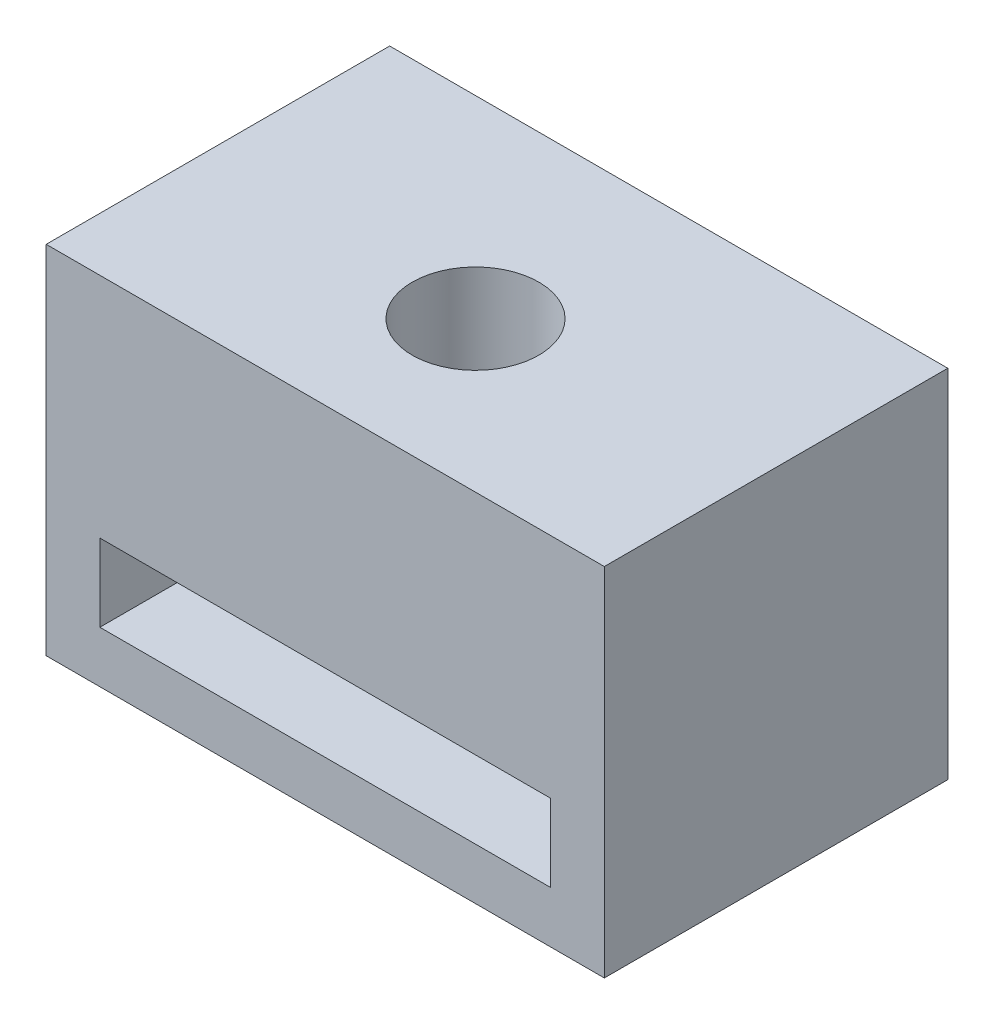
from build123d import *

# Parameters (mm, degrees)
ESQUISSE1_W             = 13
ESQUISSE1_H             = 8.3
ESQUISSE1_W_2           = 10.5
ESQUISSE1_H_2           = 1.8
BOSS_EXTRU_1_DEPTH      = 8
ESQUISSE2_R             = 1.475
ENL_V_MAT_EXTRU_1_DEPTH = 18.374982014


with BuildPart() as part:
    # Esquisse1 → Boss.-Extru.1 (new body)
    with BuildSketch(Plane.XY):
        with Locations((6.5, 4.15)):
            Rectangle(ESQUISSE1_W, ESQUISSE1_H)
        with Locations((6.5, 2.1)):
            Rectangle(ESQUISSE1_W_2, ESQUISSE1_H_2, mode=Mode.SUBTRACT)
    extrude(amount=BOSS_EXTRU_1_DEPTH)

    # Esquisse2 → Enl_v. mat.-Extru.1 (cut, through all)
    with BuildSketch(Plane(origin=(0, 8.3, 0), x_dir=(1, 0, 0), z_dir=(0, 1, 0))):
        with Locations(Location((6.5, -4.5, 0), (0, 0, 180))):
            Circle(ESQUISSE2_R)
    extrude(amount=-ENL_V_MAT_EXTRU_1_DEPTH, mode=Mode.SUBTRACT)


solid = part.part
